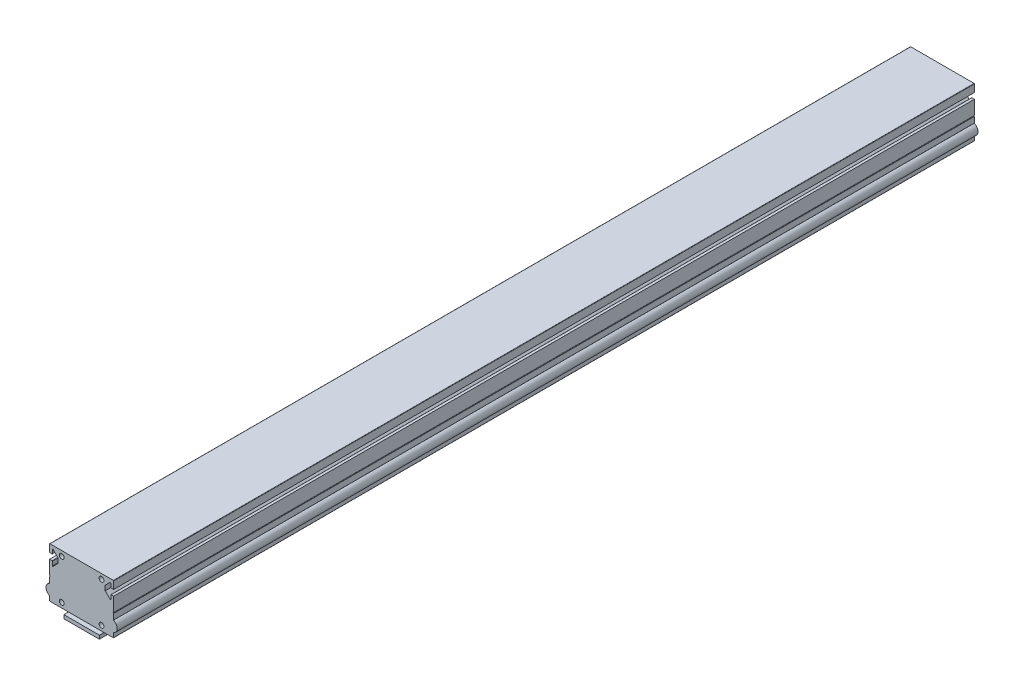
from build123d import *

# Parameters (mm, degrees)
SKIZZE1_W                                 = 90
SKIZZE1_H                                 = 70
LINEAR_AUSTRAGEN1_DEPTH                   = 1210
SKIZZE1_W_2                               = 50
SKIZZE1_H_2                               = 5
LINEAR_AUSTRAGEN1_2_DEPTH                 = 1210
SCHNITT_LINEAR_AUSTRAGEN4_DEPTH           = 1212.729033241
SCHNITT_LINEAR_AUSTRAGEN3_DEPTH           = 1212.729033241
SCHNITT_LINEAR_AUSTRAGEN5_DEPTH           = 1212.729033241
SKIZZE6_W                                 = 3.35
SKIZZE6_H                                 = 1210
F_6_7_6_7_DURCHMESSER_BOHRUNG1_AT_2_COUNT = 2
F_6_7_6_7_DURCHMESSER_BOHRUNG1_AT_2_PITCH = 56
SPIEGELN1_COPY_1_SKETCH_W                 = 3.35
SPIEGELN1_COPY_1_SKETCH_H                 = 1210
VERRUNDUNG1_R                             = 0.3
VERRUNDUNG2_R                             = 0.5
SKIZZE9_R                                 = 8.05
LINEAR_AUSTRAGEN2_DEPTH                   = 1210


with BuildPart() as part:
    # Skizze1 → Linear austragen1 (new body)
    with BuildSketch(Plane.XY):
        Rectangle(SKIZZE1_W, SKIZZE1_H)
    extrude(amount=LINEAR_AUSTRAGEN1_DEPTH)

    # Skizze5 → Schnitt-Linear austragen4 (cut, through all)
    with BuildSketch(Plane(origin=(0, 0, 0), x_dir=(-1, 0, 0), z_dir=(0, 0, -1))):
        with BuildLine():
            Line((45, 24.05), (45, 15.95))
            Line((45, 15.95), (41.5, 15.95))
            ThreePointArc((41.5, 15.95), (41.146446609, 15.803553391), (41, 15.45))
            Line((41, 15.45), (41, 10))
            ThreePointArc((41, 10), (40.691341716, 9.538060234), (40.146446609, 9.646446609))
            Line((40.146446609, 9.646446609), (33.2, 16.592893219))
            Line((33.2, 16.592893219), (33.2, 23.407106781))
            Line((33.2, 23.407106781), (40.146446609, 30.353553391))
            ThreePointArc((40.146446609, 30.353553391), (40.691341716, 30.461939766), (41, 30))
            Line((41, 30), (41, 24.55))
            ThreePointArc((41, 24.55), (41.146446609, 24.196446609), (41.5, 24.05))
            Line((41.5, 24.05), (45, 24.05))
        make_face()
    schnitt_linear_austragen4 = extrude(amount=-SCHNITT_LINEAR_AUSTRAGEN4_DEPTH, mode=Mode.SUBTRACT)

    # Skizze4 → Schnitt-Linear austragen3 (cut, through all)
    with BuildSketch(Plane(origin=(0, 0, 0), x_dir=(-1, 0, 0), z_dir=(0, 0, -1))):
        with BuildLine():
            Line((45, -13.529892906), (45, -28.470107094))
            ThreePointArc((45, -28.470107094), (33.95, -21), (45, -13.529892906))
        make_face()
    schnitt_linear_austragen3 = extrude(amount=-SCHNITT_LINEAR_AUSTRAGEN3_DEPTH, mode=Mode.SUBTRACT)

    # Skizze8 → Schnitt-Linear austragen5 (cut, through all)
    with BuildSketch(Plane(origin=(0, 0, 0), x_dir=(-1, 0, 0), z_dir=(0, 0, -1))):
        with BuildLine():
            Line((45, -3.8), (45, -5))
            ThreePointArc((45, -5), (44.4, -4.4), (45, -3.8))
        make_face()
    schnitt_linear_austragen5 = extrude(amount=-SCHNITT_LINEAR_AUSTRAGEN5_DEPTH, mode=Mode.SUBTRACT)

    # Skizze6 → 6.7 _6.7_ Durchmesser Bohrung1 (revolve, cut)
    with BuildSketch(Plane(origin=(-28, -28, 0), x_dir=(0, 1, 0), z_dir=(1, 0, 0))):
        with Locations((1.675, 605)):
            Rectangle(SKIZZE6_W, SKIZZE6_H)
    f_6_7_6_7_durchmesser_bohrung1 = revolve(axis=Axis((-28, -28, -6.35), (0, 0, 1)), mode=Mode.SUBTRACT)

    # 6.7 _6.7_ Durchmesser Bohrung1 at 2: 6.7 _6.7_ Durchmesser Bohrung1 ×2
    with Locations(*[(0, i * F_6_7_6_7_DURCHMESSER_BOHRUNG1_AT_2_PITCH, 0) for i in range(1, F_6_7_6_7_DURCHMESSER_BOHRUNG1_AT_2_COUNT)]):
        add(f_6_7_6_7_durchmesser_bohrung1, mode=Mode.SUBTRACT)

    # Spiegeln1: Schnitt-Linear austragen4, Schnitt-Linear austragen3, Schnitt-Linear austragen5, 6.7 _6.7_ Durchmesser Bohrung1 across plane
    add(schnitt_linear_austragen4.mirror(Plane(origin=(0, 0, 0), x_dir=(0, 0, 1), z_dir=(1, 0, 0))), mode=Mode.SUBTRACT)
    add(schnitt_linear_austragen3.mirror(Plane(origin=(0, 0, 0), x_dir=(0, 0, 1), z_dir=(1, 0, 0))), mode=Mode.SUBTRACT)
    add(schnitt_linear_austragen5.mirror(Plane(origin=(0, 0, 0), x_dir=(0, 0, 1), z_dir=(1, 0, 0))), mode=Mode.SUBTRACT)
    add(f_6_7_6_7_durchmesser_bohrung1.mirror(Plane(origin=(0, 0, 0), x_dir=(0, 0, 1), z_dir=(1, 0, 0))), mode=Mode.SUBTRACT)

    # Spiegeln1 copy 1 sketch → Spiegeln1 copy 1 (revolve, cut)
    with BuildSketch(Plane(origin=(28, 28, 0), x_dir=(0, 1, 0), z_dir=(-1, 0, 0))):
        with Locations((1.675, -605)):
            Rectangle(SPIEGELN1_COPY_1_SKETCH_W, SPIEGELN1_COPY_1_SKETCH_H)
    revolve(axis=Axis((28, 28, -6.35), (0, 0, -1)), mode=Mode.SUBTRACT)

    # Verrundung1
    verrundung1_edges = [part.edges().sort_by_distance(p)[0] for p in [
        (45, -13.529892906, 605),
        (45, -28.470107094, 605),
        (-45, -28.470107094, 605),
        (-45, -13.529892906, 605),
    ]]
    fillet(verrundung1_edges, radius=VERRUNDUNG1_R)

    # Verrundung2
    verrundung2_edges = [part.edges().sort_by_distance(p)[0] for p in [
        (-45, 35, 605),
        (45, 35, 605),
        (45, -35, 605),
        (-45, -35, 605),
    ]]
    fillet(verrundung2_edges, radius=VERRUNDUNG2_R)

    # Skizze9 → Linear austragen2 (add)
    with BuildSketch(Plane(origin=(0, 0, 0), x_dir=(-1, 0, 0), z_dir=(0, 0, -1))):
        with Locations((-42, -21)):
            Circle(SKIZZE9_R)
        with Locations((42, -21)):
            Circle(SKIZZE9_R)
    extrude(amount=-LINEAR_AUSTRAGEN2_DEPTH)


with BuildPart() as body_2:
    # Skizze1 → Linear austragen1 2 (new body)
    with BuildSketch(Plane.XY):
        with Locations((0, -44)):
            Rectangle(SKIZZE1_W_2, SKIZZE1_H_2)
    extrude(amount=LINEAR_AUSTRAGEN1_2_DEPTH)


solid = Compound([part.part, body_2.part])
